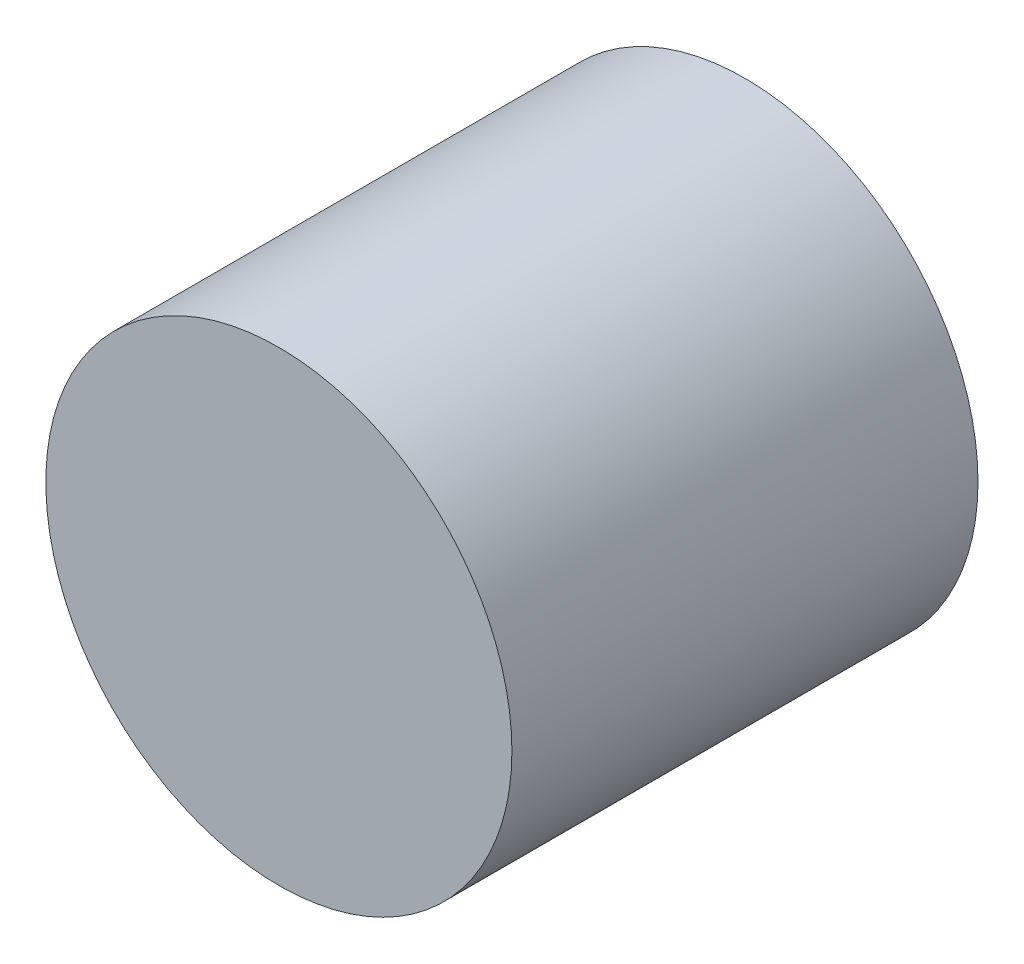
from build123d import *

# Parameters (mm, degrees)
SKETCH1_R           = 1
BOSS_EXTRUDE1_DEPTH = 2


with BuildPart() as part:
    # Sketch1 → Boss-Extrude1 (new body)
    with BuildSketch(Plane.XY):
        Circle(SKETCH1_R)
    extrude(amount=BOSS_EXTRUDE1_DEPTH)


solid = part.part
